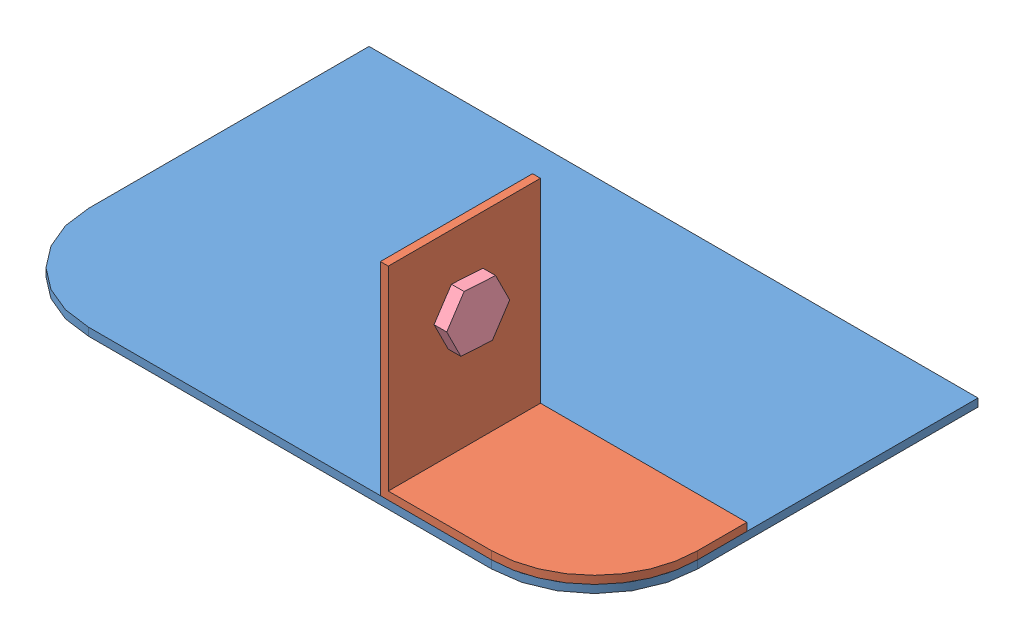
SolidWorks assembly mirror.SLDASM, configuration Default (file format 3400). Lengths in mm.
Overall size (195.17 67.51 122.88).
4 component instances, 4 part files, 7 mates.
Components (placement in the parent):
- plate-1: plate.SLDPRT [Default] at origin size (195.17 2.54 122.88)
- Bracket-1: Bracket.SLDPRT [Default] at (28.9228 2.54 12.6695) size (68.66 64.97 48.77)
- Nut-1: Nut.SLDPRT [Default] at (22.5728 43.3338 36.6812) x (0 0 -1) z (1 0 0) size (18.97 21.58 6.35)
- Bolt-1: Bolt.SLDPRT [Default] at (31.4628 59.2809 -7.8877) x (0 0.982307 -0.18728) z (1 0 0) size (18.66 20.05 16)
Mates (geometry in assembly coordinates):
- Concentric2: concentric aligned: cylinder of Bracket-1; cylinder of Bolt-1
- Coincident20: coincident anti-aligned: plane of Bracket-1 through (31.4628 67.5134 61.4375) normal (1 0 0); plane of Bolt-1 through (31.4628 25.8544 37.723) normal (-1 0 0)
- Coincident21: coincident aligned: plane of Bracket-1 through (97.5836 2.54 61.4375) normal (0 0 1); plane of plate-1 through (-97.5836 2.54 61.4375) normal (0 0 1)
- Coincident22: coincident aligned: plane of plate-1 through (97.5836 2.54 -61.4375) normal (1 0 0); plane of Bracket-1 through (97.5836 5.08 61.4375) normal (1 0 0)
- Coincident23: coincident anti-aligned: plane of plate-1 through (-97.5836 2.54 -61.4375) normal (0 1 0); plane of Bracket-1 through (28.9228 2.54 61.4375) normal (0 -1 0)
- Concentric3: concentric anti-aligned: cylinder of Bracket-1; cylinder of Nut-1
- Coincident24: coincident anti-aligned: plane of Bracket-1 through (28.9228 67.5134 61.4375) normal (-1 0 0); plane of Nut-1 through (28.9228 59.7617 27.7503) normal (1 0 0)
